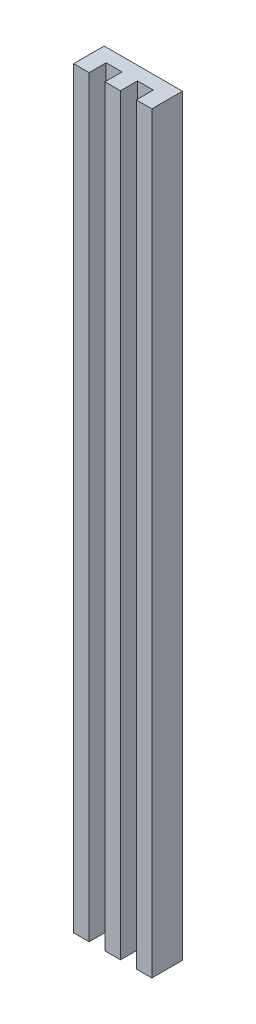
from build123d import *

# Parameters (mm, degrees)
BOSS_EXTRU_1_DEPTH = 75


with BuildPart() as part:
    # Esquisse1 → Boss.-Extru.1 (new, symmetric)
    with BuildSketch(Plane(origin=(0, 0, 0), x_dir=(1, 0, 0), z_dir=(0, 1, 0))):
        Polygon((0, 0), (0, 6.1), (15.6, 6.1), (15.6, 0), (12.5, 0), (12.5, 3.4), (9.35, 3.4), (9.35, 0), (6.25, 0), (6.25, 3.4), (3.1, 3.4), (3.1, 0), align=None)
    extrude(amount=BOSS_EXTRU_1_DEPTH, both=True)


solid = part.part
